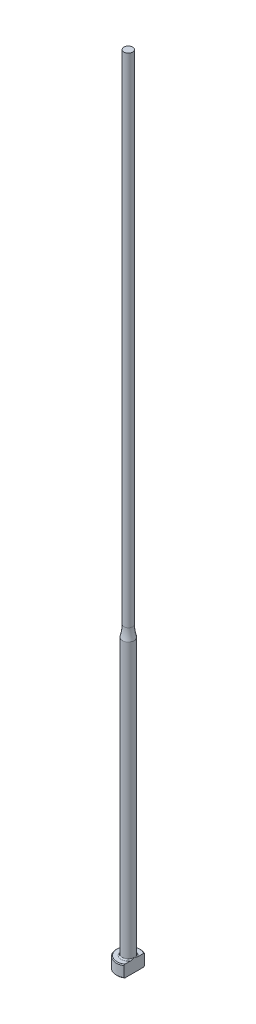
ISO-10303-21;
HEADER;
FILE_DESCRIPTION(('STEP AP214'),'2;1');
FILE_NAME('part.step','',(''),(''),'','','');
FILE_SCHEMA(('AUTOMOTIVE_DESIGN { 1 0 10303 214 1 1 1 1 }'));
ENDSEC;
DATA;
#1=APPLICATION_CONTEXT('core data for automotive mechanical design processes');
#2=APPLICATION_PROTOCOL_DEFINITION('international standard','automotive_design',2000,#1);
#3=PRODUCT_CONTEXT('',#1,'mechanical');
#4=PRODUCT('Part','Part','',(#3));
#5=PRODUCT_RELATED_PRODUCT_CATEGORY('part','',(#4));
#6=PRODUCT_DEFINITION_FORMATION('','',#4);
#7=PRODUCT_DEFINITION_CONTEXT('part definition',#1,'design');
#8=PRODUCT_DEFINITION('design','',#6,#7);
#9=PRODUCT_DEFINITION_SHAPE('','',#8);
#10=(LENGTH_UNIT() NAMED_UNIT(*) SI_UNIT(.MILLI.,.METRE.));
#11=(NAMED_UNIT(*) PLANE_ANGLE_UNIT() SI_UNIT($,.RADIAN.));
#12=(NAMED_UNIT(*) SI_UNIT($,.STERADIAN.) SOLID_ANGLE_UNIT());
#13=UNCERTAINTY_MEASURE_WITH_UNIT(LENGTH_MEASURE(1.E-05),#10,'distance_accuracy_value','');
#14=(GEOMETRIC_REPRESENTATION_CONTEXT(3) GLOBAL_UNCERTAINTY_ASSIGNED_CONTEXT((#13)) GLOBAL_UNIT_ASSIGNED_CONTEXT((#10,
#11,#12)) REPRESENTATION_CONTEXT('',''));
#15=CARTESIAN_POINT('',(0.,0.,0.));
#16=DIRECTION('',(0.,0.,1.));
#17=DIRECTION('',(1.,0.,0.));
#18=AXIS2_PLACEMENT_3D('',#15,#16,#17);
#19=CARTESIAN_POINT('',(-2.99999999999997,3.,0.));
#20=DIRECTION('',(0.,1.,0.));
#21=DIRECTION('',(0.,0.,1.));
#22=AXIS2_PLACEMENT_3D('',#19,#20,#21);
#23=PLANE('',#22);
#24=CARTESIAN_POINT('',(0.,3.,0.));
#25=DIRECTION('',(0.,1.,0.));
#26=DIRECTION('',(0.,0.,1.));
#27=AXIS2_PLACEMENT_3D('',#24,#25,#26);
#28=CIRCLE('',#27,2.79999999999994);
#29=CARTESIAN_POINT('',(1.49999999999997,3.,-2.36431808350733));
#30=VERTEX_POINT('',#29);
#31=CARTESIAN_POINT('',(1.49999999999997,3.,2.36431808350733));
#32=VERTEX_POINT('',#31);
#33=EDGE_CURVE('E187',#30,#32,#28,.T.);
#34=ORIENTED_EDGE('',*,*,#33,.T.);
#35=DIRECTION('',(0.,0.,-1.));
#36=VECTOR('',#35,1.);
#37=CARTESIAN_POINT('',(1.49999999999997,3.,0.));
#38=LINE('',#37,#36);
#39=CARTESIAN_POINT('',(1.49999999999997,3.00000000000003,0.99498743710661));
#40=VERTEX_POINT('',#39);
#41=EDGE_CURVE('E57',#32,#40,#38,.T.);
#42=ORIENTED_EDGE('',*,*,#41,.T.);
#43=CARTESIAN_POINT('',(0.,3.,0.));
#44=DIRECTION('',(0.,1.,0.));
#45=DIRECTION('',(0.,0.,1.));
#46=AXIS2_PLACEMENT_3D('',#43,#44,#45);
#47=CIRCLE('',#46,1.79999999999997);
#48=CARTESIAN_POINT('',(1.49999999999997,3.00000000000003,-0.994987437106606));
#49=VERTEX_POINT('',#48);
#50=EDGE_CURVE('E108',#40,#49,#47,.F.);
#51=ORIENTED_EDGE('',*,*,#50,.T.);
#52=EDGE_CURVE('E137',#49,#30,#38,.T.);
#53=ORIENTED_EDGE('',*,*,#52,.T.);
#54=EDGE_LOOP('',(#34,#42,#51,#53));
#55=FACE_BOUND('',#54,.T.);
#56=ADVANCED_FACE('F32',(#55),#23,.T.);
#57=CARTESIAN_POINT('',(0.,259.958771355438,0.));
#58=DIRECTION('',(0.,1.,0.));
#59=DIRECTION('',(0.,0.,1.));
#60=AXIS2_PLACEMENT_3D('',#57,#58,#59);
#61=CYLINDRICAL_SURFACE('',#60,2.99999999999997);
#62=CARTESIAN_POINT('',(0.,2.79999999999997,0.));
#63=DIRECTION('',(0.,1.,0.));
#64=DIRECTION('',(0.,0.,1.));
#65=AXIS2_PLACEMENT_3D('',#62,#63,#64);
#66=CIRCLE('',#65,2.99999999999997);
#67=CARTESIAN_POINT('',(1.49999999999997,2.79999999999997,2.5980762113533));
#68=VERTEX_POINT('',#67);
#69=CARTESIAN_POINT('',(1.49999999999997,2.79999999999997,-2.5980762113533));
#70=VERTEX_POINT('',#69);
#71=EDGE_CURVE('E105',#68,#70,#66,.F.);
#72=ORIENTED_EDGE('',*,*,#71,.T.);
#73=DIRECTION('',(0.,-1.,0.));
#74=VECTOR('',#73,1.);
#75=CARTESIAN_POINT('',(1.49999999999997,200.,-2.5980762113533));
#76=LINE('',#75,#74);
#77=CARTESIAN_POINT('',(1.49999999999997,0.200000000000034,-2.5980762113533));
#78=VERTEX_POINT('',#77);
#79=EDGE_CURVE('E193',#70,#78,#76,.T.);
#80=ORIENTED_EDGE('',*,*,#79,.T.);
#81=CARTESIAN_POINT('',(0.,0.200000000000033,0.));
#82=DIRECTION('',(0.,-1.,0.));
#83=DIRECTION('',(0.,0.,-1.));
#84=AXIS2_PLACEMENT_3D('',#81,#82,#83);
#85=CIRCLE('',#84,2.99999999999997);
#86=CARTESIAN_POINT('',(1.49999999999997,0.200000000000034,2.5980762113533));
#87=VERTEX_POINT('',#86);
#88=EDGE_CURVE('E100',#78,#87,#85,.F.);
#89=ORIENTED_EDGE('',*,*,#88,.T.);
#90=DIRECTION('',(0.,-1.,0.));
#91=VECTOR('',#90,1.);
#92=CARTESIAN_POINT('',(1.49999999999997,200.,2.5980762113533));
#93=LINE('',#92,#91);
#94=EDGE_CURVE('E93',#68,#87,#93,.T.);
#95=ORIENTED_EDGE('',*,*,#94,.F.);
#96=EDGE_LOOP('',(#72,#80,#89,#95));
#97=FACE_BOUND('',#96,.T.);
#98=ADVANCED_FACE('F158',(#97),#61,.T.);
#99=CARTESIAN_POINT('',(0.,0.,0.));
#100=DIRECTION('',(0.,-1.,0.));
#101=DIRECTION('',(0.,0.,-1.));
#102=AXIS2_PLACEMENT_3D('',#99,#100,#101);
#103=PLANE('',#102);
#104=CARTESIAN_POINT('',(0.,0.,0.));
#105=DIRECTION('',(0.,-1.,0.));
#106=DIRECTION('',(0.,0.,-1.));
#107=AXIS2_PLACEMENT_3D('',#104,#105,#106);
#108=CIRCLE('',#107,2.79999999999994);
#109=CARTESIAN_POINT('',(1.49999999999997,0.,2.36431808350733));
#110=VERTEX_POINT('',#109);
#111=CARTESIAN_POINT('',(1.49999999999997,0.,-2.36431808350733));
#112=VERTEX_POINT('',#111);
#113=EDGE_CURVE('E98',#110,#112,#108,.T.);
#114=ORIENTED_EDGE('',*,*,#113,.T.);
#115=DIRECTION('',(0.,0.,1.));
#116=VECTOR('',#115,1.);
#117=CARTESIAN_POINT('',(1.49999999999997,0.,-2.5980762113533));
#118=LINE('',#117,#116);
#119=EDGE_CURVE('E83',#112,#110,#118,.T.);
#120=ORIENTED_EDGE('',*,*,#119,.T.);
#121=EDGE_LOOP('',(#114,#120));
#122=FACE_BOUND('',#121,.T.);
#123=ADVANCED_FACE('F103',(#122),#103,.T.);
#124=CARTESIAN_POINT('',(0.,3.,0.));
#125=DIRECTION('',(0.,-1.,0.));
#126=DIRECTION('',(0.,0.,-1.));
#127=AXIS2_PLACEMENT_3D('',#124,#125,#126);
#128=CONICAL_SURFACE('',#127,2.79999999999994,0.785398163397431);
#129=ORIENTED_EDGE('',*,*,#71,.F.);
#130=CARTESIAN_POINT('',(1.49999999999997,-0.11174109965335,5.71827621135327));
#131=CARTESIAN_POINT('',(1.49999999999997,0.0136183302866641,5.58866816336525));
#132=CARTESIAN_POINT('',(1.49999999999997,0.138843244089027,5.45892957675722));
#133=CARTESIAN_POINT('',(1.49999999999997,0.388944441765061,5.19911365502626));
#134=CARTESIAN_POINT('',(1.49999999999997,0.513820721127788,5.06903631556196));
#135=CARTESIAN_POINT('',(1.49999999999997,0.763205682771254,4.80840180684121));
#136=CARTESIAN_POINT('',(1.49999999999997,0.887714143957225,4.67784442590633));
#137=CARTESIAN_POINT('',(1.49999999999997,1.13618059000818,4.4162081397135));
#138=CARTESIAN_POINT('',(1.49999999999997,1.26013857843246,4.28512923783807));
#139=CARTESIAN_POINT('',(1.49999999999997,1.50488975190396,4.02490837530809));
#140=CARTESIAN_POINT('',(1.49999999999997,1.62569693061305,3.8957795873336));
#141=CARTESIAN_POINT('',(1.49999999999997,1.86640694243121,3.63668213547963));
#142=CARTESIAN_POINT('',(1.49999999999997,1.98630978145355,3.50671347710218));
#143=CARTESIAN_POINT('',(1.49999999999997,2.2248603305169,3.24567921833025));
#144=CARTESIAN_POINT('',(1.49999999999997,2.3435083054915,3.11461386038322));
#145=CARTESIAN_POINT('',(1.49999999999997,2.5790771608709,2.85094268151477));
#146=CARTESIAN_POINT('',(1.49999999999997,2.69599811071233,2.71833692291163));
#147=CARTESIAN_POINT('',(1.49999999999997,2.88262371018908,2.50255231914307));
#148=CARTESIAN_POINT('',(1.49999999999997,2.95312454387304,2.42006293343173));
#149=CARTESIAN_POINT('',(1.49999999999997,3.09287098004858,2.25401084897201));
#150=CARTESIAN_POINT('',(1.49999999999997,3.16211645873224,2.17044804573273));
#151=CARTESIAN_POINT('',(1.49999999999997,3.29964684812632,2.00105967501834));
#152=CARTESIAN_POINT('',(1.49999999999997,3.36791386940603,1.9152195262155));
#153=CARTESIAN_POINT('',(1.49999999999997,3.50205840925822,1.7417139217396));
#154=CARTESIAN_POINT('',(1.49999999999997,3.56793649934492,1.65404891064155));
#155=CARTESIAN_POINT('',(1.49999999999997,3.69728151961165,1.47490236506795));
#156=CARTESIAN_POINT('',(1.49999999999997,3.76069661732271,1.38338308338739));
#157=CARTESIAN_POINT('',(1.49999999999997,3.88239539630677,1.19675661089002));
#158=CARTESIAN_POINT('',(1.49999999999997,3.94067201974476,1.10164473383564));
#159=CARTESIAN_POINT('',(1.49999999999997,4.048413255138,0.908008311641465));
#160=CARTESIAN_POINT('',(1.49999999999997,4.09797809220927,0.809540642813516));
#161=CARTESIAN_POINT('',(1.49999999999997,4.18432188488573,0.60719295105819));
#162=CARTESIAN_POINT('',(1.49999999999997,4.22114374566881,0.503332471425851));
#163=CARTESIAN_POINT('',(1.49999999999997,4.26099935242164,0.3475775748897));
#164=CARTESIAN_POINT('',(1.49999999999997,4.2715702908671,0.297609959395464));
#165=CARTESIAN_POINT('',(1.49999999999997,4.28794860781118,0.196885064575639));
#166=CARTESIAN_POINT('',(1.49999999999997,4.29375640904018,0.146127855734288));
#167=CARTESIAN_POINT('',(1.49999999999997,4.30019707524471,0.0444388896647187));
#168=CARTESIAN_POINT('',(1.49999999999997,4.30084594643,-0.00649183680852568));
#169=CARTESIAN_POINT('',(1.49999999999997,4.29696416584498,-0.108155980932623));
#170=CARTESIAN_POINT('',(1.49999999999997,4.29243308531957,-0.158889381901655));
#171=CARTESIAN_POINT('',(1.49999999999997,4.27856915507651,-0.259234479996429));
#172=CARTESIAN_POINT('',(1.49999999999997,4.2692782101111,-0.308852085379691));
#173=CARTESIAN_POINT('',(1.49999999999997,4.24647108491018,-0.407110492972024));
#174=CARTESIAN_POINT('',(1.49999999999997,4.23295324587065,-0.45575090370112));
#175=CARTESIAN_POINT('',(1.49999999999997,4.20226175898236,-0.55214996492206));
#176=CARTESIAN_POINT('',(1.49999999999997,4.18506801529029,-0.599902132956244));
#177=CARTESIAN_POINT('',(1.49999999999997,4.14771387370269,-0.694205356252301));
#178=CARTESIAN_POINT('',(1.49999999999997,4.12755408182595,-0.740756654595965));
#179=CARTESIAN_POINT('',(1.49999999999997,4.0632769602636,-0.879166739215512));
#180=CARTESIAN_POINT('',(1.49999999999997,4.01551721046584,-0.969329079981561));
#181=CARTESIAN_POINT('',(1.49999999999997,3.91367909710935,-1.14604316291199));
#182=CARTESIAN_POINT('',(1.49999999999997,3.85959300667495,-1.2325903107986));
#183=CARTESIAN_POINT('',(1.49999999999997,3.74697968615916,-1.40321348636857));
#184=CARTESIAN_POINT('',(1.49999999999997,3.68843573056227,-1.4872783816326));
#185=CARTESIAN_POINT('',(1.49999999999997,3.5684384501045,-1.65322187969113));
#186=CARTESIAN_POINT('',(1.49999999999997,3.50698656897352,-1.73510153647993));
#187=CARTESIAN_POINT('',(1.49999999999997,3.3811567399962,-1.89829823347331));
#188=CARTESIAN_POINT('',(1.49999999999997,3.31675092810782,-1.97959369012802));
#189=CARTESIAN_POINT('',(1.49999999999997,3.18634068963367,-2.14090082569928));
#190=CARTESIAN_POINT('',(1.49999999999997,3.12033609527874,-2.22091236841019));
#191=CARTESIAN_POINT('',(1.49999999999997,2.92086431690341,-2.45906508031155));
#192=CARTESIAN_POINT('',(1.49999999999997,2.78562663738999,-2.61572090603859));
#193=CARTESIAN_POINT('',(1.49999999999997,2.53554498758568,-2.90006295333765));
#194=CARTESIAN_POINT('',(1.49999999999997,2.42114543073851,-3.02814382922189));
#195=CARTESIAN_POINT('',(1.49999999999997,2.1909355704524,-3.28303767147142));
#196=CARTESIAN_POINT('',(1.49999999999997,2.07512522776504,-3.40985060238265));
#197=CARTESIAN_POINT('',(1.49999999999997,1.72597067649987,-3.78913849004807));
#198=CARTESIAN_POINT('',(1.49999999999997,1.49111760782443,-4.04022177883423));
#199=CARTESIAN_POINT('',(1.49999999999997,1.0288247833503,-4.52992803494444));
#200=CARTESIAN_POINT('',(1.49999999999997,0.801477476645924,-4.76863870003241));
#201=CARTESIAN_POINT('',(1.49999999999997,0.459548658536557,-5.12558036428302));
#202=CARTESIAN_POINT('',(1.49999999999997,0.345484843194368,-5.24430773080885));
#203=CARTESIAN_POINT('',(1.49999999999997,0.117071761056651,-5.48148573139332));
#204=CARTESIAN_POINT('',(1.49999999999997,0.00272249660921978,-5.59993636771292));
#205=CARTESIAN_POINT('',(1.49999999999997,-0.11174109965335,-5.71827621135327));
#206=B_SPLINE_CURVE_WITH_KNOTS('',3,(#130,#131,#132,#133,#134,#135,#136,#137,#138,#139,#140,
#141,#142,#143,#144,#145,#146,#147,#148,#149,#150,#151,#152,#153,#154,#155,#156,#157,#158,#159,
#160,#161,#162,#163,#164,#165,#166,#167,#168,#169,#170,#171,#172,#173,#174,#175,#176,#177,#178,
#179,#180,#181,#182,#183,#184,#185,#186,#187,#188,#189,#190,#191,#192,#193,#194,#195,#196,#197,
#198,#199,#200,#201,#202,#203,#204,#205),.UNSPECIFIED.,.F.,.F.,(4,2,2,2,2,2,2,2,2,2,2,2,2,2,2,2,
2,2,2,2,2,2,2,2,2,2,2,2,2,2,2,2,2,2,2,2,2,4),(0.,0.540943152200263,1.08189327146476,
1.62312052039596,2.16434426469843,2.69482920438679,3.22531067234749,3.75567781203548,
4.28602356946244,4.61155053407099,4.9371094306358,5.26610945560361,5.59503024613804,
5.92894782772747,6.26331713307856,6.59354403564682,6.92264800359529,7.07567478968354,
7.2286879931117,7.38122626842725,7.53377717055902,7.6850075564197,7.83629736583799,
7.98843643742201,8.14054446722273,8.44618799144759,8.75220879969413,9.05944044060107,
9.3665211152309,9.6776428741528,9.98879742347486,10.609592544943,11.1247803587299,
11.6399825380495,12.6713544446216,13.6603005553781,14.1542238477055,14.6481430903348),.UNSPECIFIED.);
#207=EDGE_CURVE('E136',#68,#32,#206,.T.);
#208=ORIENTED_EDGE('',*,*,#207,.T.);
#209=ORIENTED_EDGE('',*,*,#33,.F.);
#210=EDGE_CURVE('E128',#30,#70,#206,.T.);
#211=ORIENTED_EDGE('',*,*,#210,.T.);
#212=EDGE_LOOP('',(#129,#208,#209,#211));
#213=FACE_BOUND('',#212,.T.);
#214=ADVANCED_FACE('F144',(#213),#128,.T.);
#215=CARTESIAN_POINT('',(0.,0.200000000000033,0.));
#216=DIRECTION('',(0.,1.,0.));
#217=DIRECTION('',(0.,0.,1.));
#218=AXIS2_PLACEMENT_3D('',#215,#216,#217);
#219=CONICAL_SURFACE('',#218,2.99999999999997,0.785398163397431);
#220=ORIENTED_EDGE('',*,*,#88,.F.);
#221=CARTESIAN_POINT('',(1.49999999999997,3.11174109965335,-5.71827621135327));
#222=CARTESIAN_POINT('',(1.49999999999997,2.98638166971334,-5.58866816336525));
#223=CARTESIAN_POINT('',(1.49999999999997,2.86115675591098,-5.45892957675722));
#224=CARTESIAN_POINT('',(1.49999999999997,2.61105555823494,-5.19911365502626));
#225=CARTESIAN_POINT('',(1.49999999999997,2.48617927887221,-5.06903631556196));
#226=CARTESIAN_POINT('',(1.49999999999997,2.23679431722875,-4.80840180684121));
#227=CARTESIAN_POINT('',(1.49999999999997,2.11228585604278,-4.67784442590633));
#228=CARTESIAN_POINT('',(1.49999999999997,1.86381940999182,-4.4162081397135));
#229=CARTESIAN_POINT('',(1.49999999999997,1.73986142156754,-4.28512923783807));
#230=CARTESIAN_POINT('',(1.49999999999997,1.49511024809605,-4.02490837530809));
#231=CARTESIAN_POINT('',(1.49999999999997,1.37430306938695,-3.8957795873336));
#232=CARTESIAN_POINT('',(1.49999999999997,1.13359305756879,-3.63668213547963));
#233=CARTESIAN_POINT('',(1.49999999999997,1.01369021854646,-3.50671347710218));
#234=CARTESIAN_POINT('',(1.49999999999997,0.775139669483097,-3.24567921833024));
#235=CARTESIAN_POINT('',(1.49999999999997,0.656491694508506,-3.11461386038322));
#236=CARTESIAN_POINT('',(1.49999999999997,0.420922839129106,-2.85094268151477));
#237=CARTESIAN_POINT('',(1.49999999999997,0.304001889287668,-2.71833692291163));
#238=CARTESIAN_POINT('',(1.49999999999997,0.117376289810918,-2.50255231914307));
#239=CARTESIAN_POINT('',(1.49999999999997,0.0468754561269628,-2.42006293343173));
#240=CARTESIAN_POINT('',(1.49999999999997,-0.0928709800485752,-2.254010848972));
#241=CARTESIAN_POINT('',(1.49999999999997,-0.162116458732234,-2.17044804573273));
#242=CARTESIAN_POINT('',(1.49999999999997,-0.299646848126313,-2.00105967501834));
#243=CARTESIAN_POINT('',(1.49999999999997,-0.367913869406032,-1.9152195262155));
#244=CARTESIAN_POINT('',(1.49999999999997,-0.502058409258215,-1.7417139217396));
#245=CARTESIAN_POINT('',(1.49999999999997,-0.567936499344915,-1.65404891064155));
#246=CARTESIAN_POINT('',(1.49999999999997,-0.697281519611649,-1.47490236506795));
#247=CARTESIAN_POINT('',(1.49999999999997,-0.760696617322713,-1.38338308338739));
#248=CARTESIAN_POINT('',(1.49999999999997,-0.882395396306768,-1.19675661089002));
#249=CARTESIAN_POINT('',(1.49999999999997,-0.940672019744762,-1.10164473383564));
#250=CARTESIAN_POINT('',(1.49999999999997,-1.04841325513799,-0.908008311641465));
#251=CARTESIAN_POINT('',(1.49999999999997,-1.09797809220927,-0.809540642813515));
#252=CARTESIAN_POINT('',(1.49999999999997,-1.18432188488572,-0.607192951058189));
#253=CARTESIAN_POINT('',(1.49999999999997,-1.22114374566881,-0.503332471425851));
#254=CARTESIAN_POINT('',(1.49999999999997,-1.26099935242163,-0.3475775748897));
#255=CARTESIAN_POINT('',(1.49999999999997,-1.2715702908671,-0.297609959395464));
#256=CARTESIAN_POINT('',(1.49999999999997,-1.28794860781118,-0.19688506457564));
#257=CARTESIAN_POINT('',(1.49999999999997,-1.29375640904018,-0.146127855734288));
#258=CARTESIAN_POINT('',(1.49999999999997,-1.30019707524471,-0.0444388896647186));
#259=CARTESIAN_POINT('',(1.49999999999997,-1.30084594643,0.00649183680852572));
#260=CARTESIAN_POINT('',(1.49999999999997,-1.29696416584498,0.108155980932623));
#261=CARTESIAN_POINT('',(1.49999999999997,-1.29243308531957,0.158889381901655));
#262=CARTESIAN_POINT('',(1.49999999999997,-1.2785691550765,0.259234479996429));
#263=CARTESIAN_POINT('',(1.49999999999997,-1.2692782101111,0.308852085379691));
#264=CARTESIAN_POINT('',(1.49999999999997,-1.24647108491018,0.407110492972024));
#265=CARTESIAN_POINT('',(1.49999999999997,-1.23295324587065,0.45575090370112));
#266=CARTESIAN_POINT('',(1.49999999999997,-1.20226175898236,0.55214996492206));
#267=CARTESIAN_POINT('',(1.49999999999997,-1.18506801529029,0.599902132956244));
#268=CARTESIAN_POINT('',(1.49999999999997,-1.14771387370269,0.694205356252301));
#269=CARTESIAN_POINT('',(1.49999999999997,-1.12755408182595,0.740756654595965));
#270=CARTESIAN_POINT('',(1.49999999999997,-1.0632769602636,0.879166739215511));
#271=CARTESIAN_POINT('',(1.49999999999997,-1.01551721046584,0.96932907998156));
#272=CARTESIAN_POINT('',(1.49999999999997,-0.913679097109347,1.14604316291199));
#273=CARTESIAN_POINT('',(1.49999999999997,-0.85959300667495,1.2325903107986));
#274=CARTESIAN_POINT('',(1.49999999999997,-0.74697968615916,1.40321348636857));
#275=CARTESIAN_POINT('',(1.49999999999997,-0.688435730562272,1.4872783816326));
#276=CARTESIAN_POINT('',(1.49999999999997,-0.568438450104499,1.65322187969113));
#277=CARTESIAN_POINT('',(1.49999999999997,-0.50698656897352,1.73510153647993));
#278=CARTESIAN_POINT('',(1.49999999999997,-0.381156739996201,1.89829823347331));
#279=CARTESIAN_POINT('',(1.49999999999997,-0.316750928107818,1.97959369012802));
#280=CARTESIAN_POINT('',(1.49999999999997,-0.186340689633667,2.14090082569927));
#281=CARTESIAN_POINT('',(1.49999999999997,-0.120336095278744,2.22091236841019));
#282=CARTESIAN_POINT('',(1.49999999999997,0.0791356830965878,2.45906508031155));
#283=CARTESIAN_POINT('',(1.49999999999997,0.214373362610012,2.61572090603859));
#284=CARTESIAN_POINT('',(1.49999999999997,0.464455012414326,2.90006295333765));
#285=CARTESIAN_POINT('',(1.49999999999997,0.578854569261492,3.02814382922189));
#286=CARTESIAN_POINT('',(1.49999999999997,0.809064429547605,3.28303767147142));
#287=CARTESIAN_POINT('',(1.49999999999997,0.924874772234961,3.40985060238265));
#288=CARTESIAN_POINT('',(1.49999999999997,1.27402932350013,3.78913849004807));
#289=CARTESIAN_POINT('',(1.49999999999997,1.50888239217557,4.04022177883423));
#290=CARTESIAN_POINT('',(1.49999999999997,1.97117521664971,4.52992803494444));
#291=CARTESIAN_POINT('',(1.49999999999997,2.19852252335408,4.76863870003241));
#292=CARTESIAN_POINT('',(1.49999999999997,2.54045134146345,5.12558036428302));
#293=CARTESIAN_POINT('',(1.49999999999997,2.65451515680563,5.24430773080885));
#294=CARTESIAN_POINT('',(1.49999999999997,2.88292823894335,5.48148573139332));
#295=CARTESIAN_POINT('',(1.49999999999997,2.99727750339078,5.59993636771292));
#296=CARTESIAN_POINT('',(1.49999999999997,3.11174109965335,5.71827621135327));
#297=B_SPLINE_CURVE_WITH_KNOTS('',3,(#221,#222,#223,#224,#225,#226,#227,#228,#229,#230,#231,
#232,#233,#234,#235,#236,#237,#238,#239,#240,#241,#242,#243,#244,#245,#246,#247,#248,#249,#250,
#251,#252,#253,#254,#255,#256,#257,#258,#259,#260,#261,#262,#263,#264,#265,#266,#267,#268,#269,
#270,#271,#272,#273,#274,#275,#276,#277,#278,#279,#280,#281,#282,#283,#284,#285,#286,#287,#288,
#289,#290,#291,#292,#293,#294,#295,#296),.UNSPECIFIED.,.F.,.F.,(4,2,2,2,2,2,2,2,2,2,2,2,2,2,2,2,
2,2,2,2,2,2,2,2,2,2,2,2,2,2,2,2,2,2,2,2,2,4),(0.,0.540943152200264,1.08189327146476,
1.62312052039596,2.16434426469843,2.69482920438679,3.22531067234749,3.75567781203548,
4.28602356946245,4.611550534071,4.9371094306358,5.26610945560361,5.59503024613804,
5.92894782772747,6.26331713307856,6.59354403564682,6.92264800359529,7.07567478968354,
7.2286879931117,7.38122626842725,7.53377717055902,7.6850075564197,7.83629736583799,
7.98843643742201,8.14054446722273,8.44618799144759,8.75220879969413,9.05944044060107,
9.3665211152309,9.6776428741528,9.98879742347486,10.609592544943,11.1247803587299,
11.6399825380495,12.6713544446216,13.6603005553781,14.1542238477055,14.6481430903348),.UNSPECIFIED.);
#298=EDGE_CURVE('E86',#78,#112,#297,.T.);
#299=ORIENTED_EDGE('',*,*,#298,.T.);
#300=ORIENTED_EDGE('',*,*,#113,.F.);
#301=EDGE_CURVE('E89',#110,#87,#297,.T.);
#302=ORIENTED_EDGE('',*,*,#301,.T.);
#303=EDGE_LOOP('',(#220,#299,#300,#302));
#304=FACE_BOUND('',#303,.T.);
#305=ADVANCED_FACE('F97',(#304),#219,.T.);
#306=CARTESIAN_POINT('',(0.,3.30000000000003,0.));
#307=DIRECTION('',(0.,1.,0.));
#308=DIRECTION('',(0.,0.,1.));
#309=AXIS2_PLACEMENT_3D('',#306,#307,#308);
#310=TOROIDAL_SURFACE('',#309,1.79999999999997,0.3);
#311=CARTESIAN_POINT('',(1.49999999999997,3.30000000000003,0.));
#312=CARTESIAN_POINT('',(1.49999999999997,3.300000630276,3.41555678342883E-12));
#313=CARTESIAN_POINT('',(1.49999999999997,3.30000126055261,-1.15373640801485E-07));
#314=CARTESIAN_POINT('',(1.49999999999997,3.3000024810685,-4.90631575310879E-07));
#315=CARTESIAN_POINT('',(1.49999999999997,3.30000307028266,-7.53296670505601E-07));
#316=CARTESIAN_POINT('',(1.49999999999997,3.30000424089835,-1.38757096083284E-06));
#317=CARTESIAN_POINT('',(1.49999999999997,3.300004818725,-1.76563001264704E-06));
#318=CARTESIAN_POINT('',(1.49999999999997,3.30000591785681,-2.58768006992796E-06));
#319=CARTESIAN_POINT('',(1.49999999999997,3.30000643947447,-3.03127014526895E-06));
#320=CARTESIAN_POINT('',(1.49999999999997,3.30000815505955,-4.60021967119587E-06));
#321=CARTESIAN_POINT('',(1.49999999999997,3.30000927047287,-5.8124152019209E-06));
#322=CARTESIAN_POINT('',(1.49999999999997,3.30001128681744,-8.33989413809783E-06));
#323=CARTESIAN_POINT('',(1.49999999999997,3.30001219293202,-9.65128157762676E-06));
#324=CARTESIAN_POINT('',(1.49999999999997,3.30001551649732,-1.46782505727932E-05));
#325=CARTESIAN_POINT('',(1.49999999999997,3.30001775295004,-1.8517976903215E-05));
#326=CARTESIAN_POINT('',(1.49999999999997,3.30002148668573,-2.61616194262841E-05));
#327=CARTESIAN_POINT('',(1.49999999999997,3.30002302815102,-2.99447742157E-05));
#328=CARTESIAN_POINT('',(1.49999999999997,3.30002943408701,-4.58003743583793E-05));
#329=CARTESIAN_POINT('',(1.49999999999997,3.3000341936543,-5.79079078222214E-05));
#330=CARTESIAN_POINT('',(1.49999999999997,3.30004197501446,-8.07263755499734E-05));
#331=CARTESIAN_POINT('',(1.49999999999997,3.30004514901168,-9.13834709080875E-05));
#332=CARTESIAN_POINT('',(1.49999999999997,3.30006989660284,-0.000167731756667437));
#333=CARTESIAN_POINT('',(1.49999999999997,3.30010092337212,-0.000229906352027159));
#334=CARTESIAN_POINT('',(1.49999999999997,3.30021632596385,-0.000470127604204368));
#335=CARTESIAN_POINT('',(1.49999999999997,3.30029368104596,-0.000650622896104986));
#336=CARTESIAN_POINT('',(1.49999999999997,3.30059619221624,-0.00134589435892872));
#337=CARTESIAN_POINT('',(1.49999999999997,3.30082870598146,-0.00185814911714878));
#338=CARTESIAN_POINT('',(1.49999999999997,3.30176696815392,-0.00393547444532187));
#339=CARTESIAN_POINT('',(1.49999999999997,3.30246445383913,-0.00550332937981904));
#340=CARTESIAN_POINT('',(1.49999999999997,3.31426785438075,-0.0320229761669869));
#341=CARTESIAN_POINT('',(1.49999999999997,3.32544800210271,-0.0569503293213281));
#342=CARTESIAN_POINT('',(1.49999999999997,3.34725700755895,-0.105984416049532));
#343=CARTESIAN_POINT('',(1.49999999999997,3.35789134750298,-0.130088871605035));
#344=CARTESIAN_POINT('',(1.49999999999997,3.38015321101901,-0.181096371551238));
#345=CARTESIAN_POINT('',(1.49999999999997,3.39175804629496,-0.208009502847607));
#346=CARTESIAN_POINT('',(1.49999999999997,3.41469034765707,-0.262264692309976));
#347=CARTESIAN_POINT('',(1.49999999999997,3.42601398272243,-0.289608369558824));
#348=CARTESIAN_POINT('',(1.49999999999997,3.45363212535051,-0.35820378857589));
#349=CARTESIAN_POINT('',(1.49999999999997,3.46959026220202,-0.39959288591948));
#350=CARTESIAN_POINT('',(1.49999999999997,3.49940505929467,-0.482097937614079));
#351=CARTESIAN_POINT('',(1.49999999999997,3.51330033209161,-0.523199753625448));
#352=CARTESIAN_POINT('',(1.49999999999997,3.53552507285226,-0.595497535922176));
#353=CARTESIAN_POINT('',(1.49999999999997,3.54436834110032,-0.626532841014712));
#354=CARTESIAN_POINT('',(1.49999999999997,3.56052427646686,-0.6891760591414));
#355=CARTESIAN_POINT('',(1.49999999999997,3.5678279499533,-0.720786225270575));
#356=CARTESIAN_POINT('',(1.49999999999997,3.5875075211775,-0.819524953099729));
#357=CARTESIAN_POINT('',(1.49999999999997,3.59661044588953,-0.88742909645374));
#358=CARTESIAN_POINT('',(1.49999999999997,3.60059842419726,-0.991180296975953));
#359=CARTESIAN_POINT('',(1.49999999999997,3.60019840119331,-1.02684364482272));
#360=CARTESIAN_POINT('',(1.49999999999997,3.59497085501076,-1.097505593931));
#361=CARTESIAN_POINT('',(1.49999999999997,3.59019295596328,-1.13250716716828));
#362=CARTESIAN_POINT('',(1.49999999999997,3.57687734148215,-1.19353096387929));
#363=CARTESIAN_POINT('',(1.49999999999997,3.56943875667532,-1.21978854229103));
#364=CARTESIAN_POINT('',(1.49999999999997,3.55063748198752,-1.27094658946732));
#365=CARTESIAN_POINT('',(1.49999999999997,3.53927342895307,-1.29584658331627));
#366=CARTESIAN_POINT('',(1.49999999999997,3.51660016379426,-1.33501873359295));
#367=CARTESIAN_POINT('',(1.49999999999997,3.50657738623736,-1.35003296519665));
#368=CARTESIAN_POINT('',(1.49999999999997,3.48437469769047,-1.37837252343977));
#369=CARTESIAN_POINT('',(1.49999999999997,3.47219867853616,-1.39170082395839));
#370=CARTESIAN_POINT('',(1.49999999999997,3.44835614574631,-1.41349417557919));
#371=CARTESIAN_POINT('',(1.49999999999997,3.43709185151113,-1.42239673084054));
#372=CARTESIAN_POINT('',(1.49999999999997,3.41325256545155,-1.43825467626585));
#373=CARTESIAN_POINT('',(1.49999999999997,3.40067804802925,-1.44521076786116));
#374=CARTESIAN_POINT('',(1.49999999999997,3.37433767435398,-1.45677158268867));
#375=CARTESIAN_POINT('',(1.49999999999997,3.36056203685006,-1.46135438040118));
#376=CARTESIAN_POINT('',(1.49999999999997,3.33237324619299,-1.46767730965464));
#377=CARTESIAN_POINT('',(1.49999999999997,3.31796076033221,-1.46942034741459));
#378=CARTESIAN_POINT('',(1.49999999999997,3.29122479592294,-1.4698720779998));
#379=CARTESIAN_POINT('',(1.49999999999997,3.27890664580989,-1.468990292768));
#380=CARTESIAN_POINT('',(1.49999999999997,3.25461019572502,-1.4651157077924));
#381=CARTESIAN_POINT('',(1.49999999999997,3.2426318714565,-1.46212305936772));
#382=CARTESIAN_POINT('',(1.49999999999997,3.21959683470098,-1.4543117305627));
#383=CARTESIAN_POINT('',(1.49999999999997,3.20852542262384,-1.44953579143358));
#384=CARTESIAN_POINT('',(1.49999999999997,3.18721125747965,-1.43840957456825));
#385=CARTESIAN_POINT('',(1.49999999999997,3.1769687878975,-1.43205876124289));
#386=CARTESIAN_POINT('',(1.49999999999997,3.15325976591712,-1.41506353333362));
#387=CARTESIAN_POINT('',(1.49999999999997,3.14027750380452,-1.40374235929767));
#388=CARTESIAN_POINT('',(1.49999999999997,3.11630720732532,-1.37914825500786));
#389=CARTESIAN_POINT('',(1.49999999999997,3.10532420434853,-1.36587054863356));
#390=CARTESIAN_POINT('',(1.49999999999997,3.08100891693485,-1.33197272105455));
#391=CARTESIAN_POINT('',(1.49999999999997,3.06867625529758,-1.31063843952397));
#392=CARTESIAN_POINT('',(1.49999999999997,3.04751867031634,-1.26637455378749));
#393=CARTESIAN_POINT('',(1.49999999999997,3.03869240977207,-1.24344556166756));
#394=CARTESIAN_POINT('',(1.49999999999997,3.01978360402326,-1.18316534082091));
#395=CARTESIAN_POINT('',(1.49999999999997,3.01191472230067,-1.14512623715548));
#396=CARTESIAN_POINT('',(1.49999999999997,3.00188285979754,-1.06789971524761));
#397=CARTESIAN_POINT('',(1.49999999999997,2.99979735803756,-1.02870374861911));
#398=CARTESIAN_POINT('',(1.49999999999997,3.00021727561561,-0.953160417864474));
#399=CARTESIAN_POINT('',(1.49999999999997,3.00240673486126,-0.916808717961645));
#400=CARTESIAN_POINT('',(1.49999999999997,3.0099643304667,-0.844432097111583));
#401=CARTESIAN_POINT('',(1.49999999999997,3.01533462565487,-0.808407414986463));
#402=CARTESIAN_POINT('',(1.49999999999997,3.02828086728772,-0.738670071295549));
#403=CARTESIAN_POINT('',(1.49999999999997,3.03573028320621,-0.704933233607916));
#404=CARTESIAN_POINT('',(1.49999999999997,3.05243174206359,-0.638128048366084));
#405=CARTESIAN_POINT('',(1.49999999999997,3.06167285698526,-0.605056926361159));
#406=CARTESIAN_POINT('',(1.49999999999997,3.08440652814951,-0.53019513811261));
#407=CARTESIAN_POINT('',(1.49999999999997,3.09836576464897,-0.488547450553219));
#408=CARTESIAN_POINT('',(1.49999999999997,3.1283820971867,-0.404954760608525));
#409=CARTESIAN_POINT('',(1.49999999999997,3.14447968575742,-0.363024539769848));
#410=CARTESIAN_POINT('',(1.49999999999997,3.17238454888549,-0.293508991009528));
#411=CARTESIAN_POINT('',(1.49999999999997,3.18384249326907,-0.265781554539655));
#412=CARTESIAN_POINT('',(1.49999999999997,3.20705854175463,-0.210769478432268));
#413=CARTESIAN_POINT('',(1.49999999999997,3.21881265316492,-0.183483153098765));
#414=CARTESIAN_POINT('',(1.49999999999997,3.24136702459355,-0.131772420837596));
#415=CARTESIAN_POINT('',(1.49999999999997,3.25214361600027,-0.107337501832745));
#416=CARTESIAN_POINT('',(1.49999999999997,3.27424746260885,-0.0576321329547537));
#417=CARTESIAN_POINT('',(1.49999999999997,3.28558038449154,-0.0323640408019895));
#418=CARTESIAN_POINT('',(1.49999999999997,3.29753556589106,-0.00550327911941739));
#419=CARTESIAN_POINT('',(1.49999999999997,3.29823307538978,-0.00393537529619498));
#420=CARTESIAN_POINT('',(1.49999999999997,3.29917134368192,-0.00185803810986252));
#421=CARTESIAN_POINT('',(1.49999999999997,3.29940384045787,-0.00134582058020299));
#422=CARTESIAN_POINT('',(1.49999999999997,3.29970633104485,-0.000650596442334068));
#423=CARTESIAN_POINT('',(1.49999999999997,3.29978368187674,-0.000470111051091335));
#424=CARTESIAN_POINT('',(1.49999999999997,3.29989907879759,-0.000229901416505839));
#425=CARTESIAN_POINT('',(1.49999999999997,3.29993010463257,-0.000167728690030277));
#426=CARTESIAN_POINT('',(1.49999999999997,3.29995485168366,-9.13825689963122E-05));
#427=CARTESIAN_POINT('',(1.49999999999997,3.29995802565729,-8.07256241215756E-05));
#428=CARTESIAN_POINT('',(1.49999999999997,3.29996580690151,-5.79074820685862E-05));
#429=CARTESIAN_POINT('',(1.49999999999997,3.29997056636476,-4.5800119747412E-05));
#430=CARTESIAN_POINT('',(1.49999999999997,3.29997697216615,-2.99447119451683E-05));
#431=CARTESIAN_POINT('',(1.49999999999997,3.2999785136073,-2.61615817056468E-05));
#432=CARTESIAN_POINT('',(1.49999999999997,3.2999822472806,-1.85179845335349E-05));
#433=CARTESIAN_POINT('',(1.49999999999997,3.29998448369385,-1.46782782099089E-05));
#434=CARTESIAN_POINT('',(1.49999999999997,3.2999878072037,-9.65132752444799E-06));
#435=CARTESIAN_POINT('',(1.49999999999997,3.299988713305,-8.33994202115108E-06));
#436=CARTESIAN_POINT('',(1.49999999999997,3.29999072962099,-5.81246426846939E-06));
#437=CARTESIAN_POINT('',(1.49999999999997,3.29999184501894,-4.600267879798E-06));
#438=CARTESIAN_POINT('',(1.49999999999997,3.29999356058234,-3.03131394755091E-06));
#439=CARTESIAN_POINT('',(1.49999999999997,3.29999408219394,-2.58772196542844E-06));
#440=CARTESIAN_POINT('',(1.49999999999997,3.2999951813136,-1.76566701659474E-06));
#441=CARTESIAN_POINT('',(1.49999999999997,3.29999575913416,-1.38760497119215E-06));
#442=CARTESIAN_POINT('',(1.49999999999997,3.29999692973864,-7.53323425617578E-07));
#443=CARTESIAN_POINT('',(1.49999999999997,3.29999751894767,-4.90654189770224E-07));
#444=CARTESIAN_POINT('',(1.49999999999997,3.29999873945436,-1.15386267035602E-07));
#445=CARTESIAN_POINT('',(1.49999999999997,3.29999936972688,-3.41554144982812E-12));
#446=CARTESIAN_POINT('',(1.49999999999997,3.30000000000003,0.));
#447=B_SPLINE_CURVE_WITH_KNOTS('',3,(#311,#312,#313,#314,#315,#316,#317,#318,#319,#320,#321,
#322,#323,#324,#325,#326,#327,#328,#329,#330,#331,#332,#333,#334,#335,#336,#337,#338,#339,#340,
#341,#342,#343,#344,#345,#346,#347,#348,#349,#350,#351,#352,#353,#354,#355,#356,#357,#358,#359,
#360,#361,#362,#363,#364,#365,#366,#367,#368,#369,#370,#371,#372,#373,#374,#375,#376,#377,#378,
#379,#380,#381,#382,#383,#384,#385,#386,#387,#388,#389,#390,#391,#392,#393,#394,#395,#396,#397,
#398,#399,#400,#401,#402,#403,#404,#405,#406,#407,#408,#409,#410,#411,#412,#413,#414,#415,#416,
#417,#418,#419,#420,#421,#422,#423,#424,#425,#426,#427,#428,#429,#430,#431,#432,#433,#434,#435,
#436,#437,#438,#439,#440,#441,#442,#443,#444,#445,#446),.UNSPECIFIED.,.T.,.F.,(4,2,2,2,2,2,2,2,
2,2,2,2,2,2,2,2,2,2,2,2,2,2,2,2,2,2,2,2,2,2,2,2,2,2,2,2,2,2,2,2,2,2,2,2,2,2,2,2,2,2,2,2,2,2,2,2,
2,2,2,2,2,2,2,2,2,2,2,4),(0.,1.88906036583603E-06,3.8150959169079E-06,5.87892837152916E-06,
7.93062024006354E-06,1.28480890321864E-05,1.76261717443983E-05,3.0909918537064E-05,
4.31529750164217E-05,8.21699329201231E-05,0.000115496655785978,0.000323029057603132,
0.000912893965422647,0.00259963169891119,0.00774858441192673,0.0896975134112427,
0.168737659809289,0.256660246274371,0.345444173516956,0.478492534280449,0.608603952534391,
0.705372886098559,0.802692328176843,1.00719557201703,1.11399616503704,1.21960092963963,
1.30124317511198,1.38291380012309,1.43690814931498,1.49080588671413,1.53371524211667,
1.57660911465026,1.61989249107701,1.66313154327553,1.69999492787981,1.73685567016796,
1.77288440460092,1.80892540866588,1.86031324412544,1.91182866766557,1.98534297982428,
2.05882922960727,2.1747172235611,2.29215041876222,2.40123170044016,2.51038710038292,
2.613972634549,2.71694519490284,2.84866234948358,2.98337525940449,3.07337666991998,
3.16250453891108,3.24262397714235,3.32569301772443,3.3308421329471,3.33252874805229,
3.33311858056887,3.33332610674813,3.33335943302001,3.33339844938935,3.3334106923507,
3.33342397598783,3.33342875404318,3.33343367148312,3.33343572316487,3.33343778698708,
3.33343971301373,3.33344160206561),.UNSPECIFIED.);
#448=CARTESIAN_POINT('',(1.49999999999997,3.30000000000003,0.));
#449=VERTEX_POINT('',#448);
#450=EDGE_CURVE('E11',#49,#449,#447,.T.);
#451=ORIENTED_EDGE('',*,*,#450,.F.);
#452=ORIENTED_EDGE('',*,*,#50,.F.);
#453=CARTESIAN_POINT('',(1.49999999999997,3.30000000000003,0.));
#454=CARTESIAN_POINT('',(1.49999999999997,3.29999936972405,-3.41547770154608E-12));
#455=CARTESIAN_POINT('',(1.49999999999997,3.29999873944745,1.15373640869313E-07));
#456=CARTESIAN_POINT('',(1.49999999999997,3.29999751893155,4.90631575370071E-07));
#457=CARTESIAN_POINT('',(1.49999999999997,3.29999692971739,7.53296670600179E-07));
#458=CARTESIAN_POINT('',(1.49999999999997,3.2999957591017,1.38757096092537E-06));
#459=CARTESIAN_POINT('',(1.49999999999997,3.29999518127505,1.76563001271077E-06));
#460=CARTESIAN_POINT('',(1.49999999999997,3.29999408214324,2.58768007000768E-06));
#461=CARTESIAN_POINT('',(1.49999999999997,3.29999356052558,3.03127014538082E-06));
#462=CARTESIAN_POINT('',(1.49999999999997,3.2999918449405,4.60021967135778E-06));
#463=CARTESIAN_POINT('',(1.49999999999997,3.29999072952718,5.81241520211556E-06));
#464=CARTESIAN_POINT('',(1.49999999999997,3.29998871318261,8.33989413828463E-06));
#465=CARTESIAN_POINT('',(1.49999999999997,3.29998780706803,9.65128157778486E-06));
#466=CARTESIAN_POINT('',(1.49999999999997,3.29998448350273,1.46782505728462E-05));
#467=CARTESIAN_POINT('',(1.49999999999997,3.29998224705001,1.85179769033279E-05));
#468=CARTESIAN_POINT('',(1.49999999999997,3.29997851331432,2.61616194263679E-05));
#469=CARTESIAN_POINT('',(1.49999999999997,3.29997697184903,2.99447742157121E-05));
#470=CARTESIAN_POINT('',(1.49999999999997,3.29997056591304,4.58003743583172E-05));
#471=CARTESIAN_POINT('',(1.49999999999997,3.29996580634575,5.79079078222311E-05));
#472=CARTESIAN_POINT('',(1.49999999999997,3.29995802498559,8.07263755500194E-05));
#473=CARTESIAN_POINT('',(1.49999999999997,3.29995485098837,9.1383470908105E-05));
#474=CARTESIAN_POINT('',(1.49999999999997,3.29993010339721,0.000167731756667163));
#475=CARTESIAN_POINT('',(1.49999999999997,3.29989907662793,0.000229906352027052));
#476=CARTESIAN_POINT('',(1.49999999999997,3.2997836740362,0.000470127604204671));
#477=CARTESIAN_POINT('',(1.49999999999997,3.2997063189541,0.000650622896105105));
#478=CARTESIAN_POINT('',(1.49999999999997,3.29940380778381,0.00134589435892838));
#479=CARTESIAN_POINT('',(1.49999999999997,3.29917129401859,0.00185814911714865));
#480=CARTESIAN_POINT('',(1.49999999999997,3.29823303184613,0.00393547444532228));
#481=CARTESIAN_POINT('',(1.49999999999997,3.29753554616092,0.00550332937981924));
#482=CARTESIAN_POINT('',(1.49999999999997,3.2857321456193,0.0320229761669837));
#483=CARTESIAN_POINT('',(1.49999999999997,3.27455199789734,0.0569503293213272));
#484=CARTESIAN_POINT('',(1.49999999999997,3.2527429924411,0.105984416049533));
#485=CARTESIAN_POINT('',(1.49999999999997,3.24210865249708,0.130088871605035));
#486=CARTESIAN_POINT('',(1.49999999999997,3.21984678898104,0.181096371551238));
#487=CARTESIAN_POINT('',(1.49999999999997,3.20824195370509,0.208009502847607));
#488=CARTESIAN_POINT('',(1.49999999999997,3.18530965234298,0.262264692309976));
#489=CARTESIAN_POINT('',(1.49999999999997,3.17398601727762,0.289608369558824));
#490=CARTESIAN_POINT('',(1.49999999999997,3.14636787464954,0.35820378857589));
#491=CARTESIAN_POINT('',(1.49999999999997,3.13040973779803,0.39959288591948));
#492=CARTESIAN_POINT('',(1.49999999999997,3.10059494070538,0.482097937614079));
#493=CARTESIAN_POINT('',(1.49999999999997,3.08669966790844,0.523199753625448));
#494=CARTESIAN_POINT('',(1.49999999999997,3.06447492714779,0.595497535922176));
#495=CARTESIAN_POINT('',(1.49999999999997,3.05563165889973,0.626532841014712));
#496=CARTESIAN_POINT('',(1.49999999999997,3.03947572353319,0.6891760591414));
#497=CARTESIAN_POINT('',(1.49999999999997,3.03217205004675,0.720786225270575));
#498=CARTESIAN_POINT('',(1.49999999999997,3.01249247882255,0.819524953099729));
#499=CARTESIAN_POINT('',(1.49999999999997,3.00338955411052,0.88742909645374));
#500=CARTESIAN_POINT('',(1.49999999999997,2.99940157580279,0.991180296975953));
#501=CARTESIAN_POINT('',(1.49999999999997,2.99980159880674,1.02684364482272));
#502=CARTESIAN_POINT('',(1.49999999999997,3.00502914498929,1.097505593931));
#503=CARTESIAN_POINT('',(1.49999999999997,3.00980704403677,1.13250716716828));
#504=CARTESIAN_POINT('',(1.49999999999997,3.0231226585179,1.19353096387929));
#505=CARTESIAN_POINT('',(1.49999999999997,3.03056124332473,1.21978854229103));
#506=CARTESIAN_POINT('',(1.49999999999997,3.04936251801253,1.27094658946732));
#507=CARTESIAN_POINT('',(1.49999999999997,3.06072657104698,1.29584658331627));
#508=CARTESIAN_POINT('',(1.49999999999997,3.08339983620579,1.33501873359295));
#509=CARTESIAN_POINT('',(1.49999999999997,3.09342261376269,1.35003296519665));
#510=CARTESIAN_POINT('',(1.49999999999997,3.11562530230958,1.37837252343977));
#511=CARTESIAN_POINT('',(1.49999999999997,3.12780132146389,1.39170082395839));
#512=CARTESIAN_POINT('',(1.49999999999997,3.15164385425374,1.41349417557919));
#513=CARTESIAN_POINT('',(1.49999999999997,3.16290814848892,1.42239673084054));
#514=CARTESIAN_POINT('',(1.49999999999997,3.1867474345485,1.43825467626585));
#515=CARTESIAN_POINT('',(1.49999999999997,3.1993219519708,1.44521076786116));
#516=CARTESIAN_POINT('',(1.49999999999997,3.22566232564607,1.45677158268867));
#517=CARTESIAN_POINT('',(1.49999999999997,3.23943796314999,1.46135438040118));
#518=CARTESIAN_POINT('',(1.49999999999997,3.26762675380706,1.46767730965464));
#519=CARTESIAN_POINT('',(1.49999999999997,3.28203923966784,1.46942034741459));
#520=CARTESIAN_POINT('',(1.49999999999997,3.30877520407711,1.4698720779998));
#521=CARTESIAN_POINT('',(1.49999999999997,3.32109335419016,1.468990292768));
#522=CARTESIAN_POINT('',(1.49999999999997,3.34538980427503,1.4651157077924));
#523=CARTESIAN_POINT('',(1.49999999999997,3.35736812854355,1.46212305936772));
#524=CARTESIAN_POINT('',(1.49999999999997,3.38040316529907,1.4543117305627));
#525=CARTESIAN_POINT('',(1.49999999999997,3.39147457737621,1.44953579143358));
#526=CARTESIAN_POINT('',(1.49999999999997,3.4127887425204,1.43840957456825));
#527=CARTESIAN_POINT('',(1.49999999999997,3.42303121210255,1.43205876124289));
#528=CARTESIAN_POINT('',(1.49999999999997,3.44674023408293,1.41506353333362));
#529=CARTESIAN_POINT('',(1.49999999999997,3.45972249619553,1.40374235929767));
#530=CARTESIAN_POINT('',(1.49999999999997,3.48369279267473,1.37914825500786));
#531=CARTESIAN_POINT('',(1.49999999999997,3.49467579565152,1.36587054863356));
#532=CARTESIAN_POINT('',(1.49999999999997,3.5189910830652,1.33197272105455));
#533=CARTESIAN_POINT('',(1.49999999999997,3.53132374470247,1.31063843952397));
#534=CARTESIAN_POINT('',(1.49999999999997,3.55248132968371,1.26637455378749));
#535=CARTESIAN_POINT('',(1.49999999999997,3.56130759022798,1.24344556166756));
#536=CARTESIAN_POINT('',(1.49999999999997,3.58021639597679,1.18316534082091));
#537=CARTESIAN_POINT('',(1.49999999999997,3.58808527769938,1.14512623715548));
#538=CARTESIAN_POINT('',(1.49999999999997,3.59811714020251,1.06789971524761));
#539=CARTESIAN_POINT('',(1.49999999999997,3.60020264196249,1.02870374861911));
#540=CARTESIAN_POINT('',(1.49999999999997,3.59978272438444,0.953160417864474));
#541=CARTESIAN_POINT('',(1.49999999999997,3.59759326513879,0.916808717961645));
#542=CARTESIAN_POINT('',(1.49999999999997,3.59003566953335,0.844432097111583));
#543=CARTESIAN_POINT('',(1.49999999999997,3.58466537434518,0.808407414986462));
#544=CARTESIAN_POINT('',(1.49999999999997,3.57171913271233,0.738670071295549));
#545=CARTESIAN_POINT('',(1.49999999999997,3.56426971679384,0.704933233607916));
#546=CARTESIAN_POINT('',(1.49999999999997,3.54756825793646,0.638128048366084));
#547=CARTESIAN_POINT('',(1.49999999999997,3.53832714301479,0.605056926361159));
#548=CARTESIAN_POINT('',(1.49999999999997,3.51559347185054,0.53019513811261));
#549=CARTESIAN_POINT('',(1.49999999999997,3.50163423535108,0.488547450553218));
#550=CARTESIAN_POINT('',(1.49999999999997,3.47161790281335,0.404954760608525));
#551=CARTESIAN_POINT('',(1.49999999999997,3.45552031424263,0.363024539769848));
#552=CARTESIAN_POINT('',(1.49999999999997,3.42761545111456,0.293508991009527));
#553=CARTESIAN_POINT('',(1.49999999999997,3.41615750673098,0.265781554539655));
#554=CARTESIAN_POINT('',(1.49999999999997,3.39294145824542,0.210769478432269));
#555=CARTESIAN_POINT('',(1.49999999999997,3.38118734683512,0.183483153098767));
#556=CARTESIAN_POINT('',(1.49999999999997,3.3586329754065,0.131772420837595));
#557=CARTESIAN_POINT('',(1.49999999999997,3.3478563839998,0.10733750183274));
#558=CARTESIAN_POINT('',(1.49999999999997,3.32575253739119,0.0576321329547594));
#559=CARTESIAN_POINT('',(1.49999999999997,3.31441961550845,0.0323640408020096));
#560=CARTESIAN_POINT('',(1.49999999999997,3.30246443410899,0.00550327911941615));
#561=CARTESIAN_POINT('',(1.49999999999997,3.30176692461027,0.00393537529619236));
#562=CARTESIAN_POINT('',(1.49999999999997,3.30082865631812,0.00185803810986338));
#563=CARTESIAN_POINT('',(1.49999999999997,3.30059615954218,0.00134582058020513));
#564=CARTESIAN_POINT('',(1.49999999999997,3.3002936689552,0.000650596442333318));
#565=CARTESIAN_POINT('',(1.49999999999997,3.30021631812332,0.000470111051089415));
#566=CARTESIAN_POINT('',(1.49999999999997,3.30010092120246,0.000229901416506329));
#567=CARTESIAN_POINT('',(1.49999999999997,3.30006989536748,0.000167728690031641));
#568=CARTESIAN_POINT('',(1.49999999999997,3.30004514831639,9.13825689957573E-05));
#569=CARTESIAN_POINT('',(1.49999999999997,3.30004197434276,8.07256241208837E-05));
#570=CARTESIAN_POINT('',(1.49999999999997,3.30003419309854,5.79074820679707E-05));
#571=CARTESIAN_POINT('',(1.49999999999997,3.30002943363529,4.58001197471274E-05));
#572=CARTESIAN_POINT('',(1.49999999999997,3.3000230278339,2.99447119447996E-05));
#573=CARTESIAN_POINT('',(1.49999999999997,3.30002148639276,2.61615817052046E-05));
#574=CARTESIAN_POINT('',(1.49999999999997,3.30001775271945,1.85179845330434E-05));
#575=CARTESIAN_POINT('',(1.49999999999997,3.3000155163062,1.46782782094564E-05));
#576=CARTESIAN_POINT('',(1.49999999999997,3.30001219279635,9.65132752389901E-06));
#577=CARTESIAN_POINT('',(1.49999999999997,3.30001128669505,8.33994202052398E-06));
#578=CARTESIAN_POINT('',(1.49999999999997,3.30000927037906,5.8124642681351E-06));
#579=CARTESIAN_POINT('',(1.49999999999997,3.30000815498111,4.60026787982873E-06));
#580=CARTESIAN_POINT('',(1.49999999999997,3.30000643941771,3.03131394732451E-06));
#581=CARTESIAN_POINT('',(1.49999999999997,3.30000591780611,2.58772196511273E-06));
#582=CARTESIAN_POINT('',(1.49999999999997,3.30000481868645,1.76566701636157E-06));
#583=CARTESIAN_POINT('',(1.49999999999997,3.30000424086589,1.38760497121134E-06));
#584=CARTESIAN_POINT('',(1.49999999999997,3.3000030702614,7.53323425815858E-07));
#585=CARTESIAN_POINT('',(1.49999999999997,3.30000248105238,4.90654189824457E-07));
#586=CARTESIAN_POINT('',(1.49999999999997,3.30000126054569,1.15386266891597E-07));
#587=CARTESIAN_POINT('',(1.49999999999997,3.30000063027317,3.41546236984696E-12));
#588=CARTESIAN_POINT('',(1.49999999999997,3.30000000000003,0.));
#589=B_SPLINE_CURVE_WITH_KNOTS('',3,(#453,#454,#455,#456,#457,#458,#459,#460,#461,#462,#463,
#464,#465,#466,#467,#468,#469,#470,#471,#472,#473,#474,#475,#476,#477,#478,#479,#480,#481,#482,
#483,#484,#485,#486,#487,#488,#489,#490,#491,#492,#493,#494,#495,#496,#497,#498,#499,#500,#501,
#502,#503,#504,#505,#506,#507,#508,#509,#510,#511,#512,#513,#514,#515,#516,#517,#518,#519,#520,
#521,#522,#523,#524,#525,#526,#527,#528,#529,#530,#531,#532,#533,#534,#535,#536,#537,#538,#539,
#540,#541,#542,#543,#544,#545,#546,#547,#548,#549,#550,#551,#552,#553,#554,#555,#556,#557,#558,
#559,#560,#561,#562,#563,#564,#565,#566,#567,#568,#569,#570,#571,#572,#573,#574,#575,#576,#577,
#578,#579,#580,#581,#582,#583,#584,#585,#586,#587,#588),.UNSPECIFIED.,.T.,.F.,(4,2,2,2,2,2,2,2,
2,2,2,2,2,2,2,2,2,2,2,2,2,2,2,2,2,2,2,2,2,2,2,2,2,2,2,2,2,2,2,2,2,2,2,2,2,2,2,2,2,2,2,2,2,2,2,2,
2,2,2,2,2,2,2,2,2,2,2,4),(0.,1.88906036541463E-06,3.81509591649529E-06,5.87892837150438E-06,
7.93062024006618E-06,1.28480890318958E-05,1.76261717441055E-05,3.09099185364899E-05,
4.3152975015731E-05,8.21699329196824E-05,0.000115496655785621,0.000323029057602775,
0.000912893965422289,0.00259963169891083,0.00774858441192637,0.0896975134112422,
0.168737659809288,0.256660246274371,0.345444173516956,0.478492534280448,0.60860395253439,
0.705372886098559,0.802692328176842,1.00719557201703,1.11399616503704,1.21960092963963,
1.30124317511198,1.38291380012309,1.43690814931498,1.49080588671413,1.53371524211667,
1.57660911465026,1.61989249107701,1.66313154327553,1.69999492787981,1.73685567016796,
1.77288440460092,1.80892540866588,1.86031324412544,1.91182866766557,1.98534297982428,
2.05882922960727,2.1747172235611,2.29215041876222,2.40123170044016,2.51038710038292,
2.613972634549,2.71694519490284,2.84866234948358,2.98337525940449,3.07337666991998,
3.16250453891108,3.24262397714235,3.32569301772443,3.3308421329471,3.33252874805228,
3.33311858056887,3.33332610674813,3.33335943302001,3.33339844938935,3.3334106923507,
3.33342397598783,3.33342875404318,3.33343367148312,3.33343572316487,3.33343778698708,
3.33343971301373,3.33344160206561),.UNSPECIFIED.);
#590=EDGE_CURVE('E46',#449,#40,#589,.T.);
#591=ORIENTED_EDGE('',*,*,#590,.F.);
#592=CARTESIAN_POINT('',(0.,3.30000000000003,0.));
#593=DIRECTION('',(0.,1.,0.));
#594=DIRECTION('',(0.,0.,1.));
#595=AXIS2_PLACEMENT_3D('',#592,#593,#594);
#596=CIRCLE('',#595,1.49999999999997);
#597=EDGE_CURVE('E104',#449,#449,#596,.T.);
#598=ORIENTED_EDGE('',*,*,#597,.F.);
#599=EDGE_LOOP('',(#451,#452,#591,#598));
#600=FACE_BOUND('',#599,.T.);
#601=ADVANCED_FACE('F34',(#600),#310,.F.);
#602=CARTESIAN_POINT('',(-1.09999999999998,200.,0.));
#603=DIRECTION('',(0.,1.,0.));
#604=DIRECTION('',(0.,0.,1.));
#605=AXIS2_PLACEMENT_3D('',#602,#603,#604);
#606=PLANE('',#605);
#607=CARTESIAN_POINT('',(0.,200.,0.));
#608=DIRECTION('',(0.,1.,0.));
#609=DIRECTION('',(0.,0.,1.));
#610=AXIS2_PLACEMENT_3D('',#607,#608,#609);
#611=CIRCLE('',#610,1.09999999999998);
#612=CARTESIAN_POINT('',(0.,200.,1.09999999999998));
#613=VERTEX_POINT('',#612);
#614=EDGE_CURVE('E186',#613,#613,#611,.T.);
#615=ORIENTED_EDGE('',*,*,#614,.T.);
#616=EDGE_LOOP('',(#615));
#617=FACE_BOUND('',#616,.T.);
#618=ADVANCED_FACE('F149',(#617),#606,.T.);
#619=CARTESIAN_POINT('',(0.,259.958771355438,0.));
#620=DIRECTION('',(0.,1.,0.));
#621=DIRECTION('',(0.,0.,1.));
#622=AXIS2_PLACEMENT_3D('',#619,#620,#621);
#623=CYLINDRICAL_SURFACE('',#622,1.09999999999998);
#624=CARTESIAN_POINT('',(0.,75.,0.));
#625=DIRECTION('',(0.,1.,0.));
#626=DIRECTION('',(0.,0.,1.));
#627=AXIS2_PLACEMENT_3D('',#624,#625,#626);
#628=CIRCLE('',#627,1.09999999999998);
#629=CARTESIAN_POINT('',(0.,75.,1.09999999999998));
#630=VERTEX_POINT('',#629);
#631=EDGE_CURVE('E183',#630,#630,#628,.T.);
#632=ORIENTED_EDGE('',*,*,#631,.T.);
#633=EDGE_LOOP('',(#632));
#634=FACE_BOUND('',#633,.T.);
#635=ORIENTED_EDGE('',*,*,#614,.F.);
#636=EDGE_LOOP('',(#635));
#637=FACE_BOUND('',#636,.T.);
#638=ADVANCED_FACE('F172',(#634,#637),#623,.T.);
#639=CARTESIAN_POINT('',(0.,75.,0.));
#640=DIRECTION('',(0.,1.,0.));
#641=DIRECTION('',(0.,0.,1.));
#642=AXIS2_PLACEMENT_3D('',#639,#640,#641);
#643=TOROIDAL_SURFACE('',#642,11.1,10.);
#644=CARTESIAN_POINT('',(0.,72.2,0.));
#645=DIRECTION('',(0.,1.,0.));
#646=DIRECTION('',(0.,0.,1.));
#647=AXIS2_PLACEMENT_3D('',#644,#645,#646);
#648=CIRCLE('',#647,1.49999999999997);
#649=CARTESIAN_POINT('',(0.,72.2,1.49999999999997));
#650=VERTEX_POINT('',#649);
#651=EDGE_CURVE('E101',#650,#650,#648,.T.);
#652=ORIENTED_EDGE('',*,*,#651,.T.);
#653=EDGE_LOOP('',(#652));
#654=FACE_BOUND('',#653,.T.);
#655=ORIENTED_EDGE('',*,*,#631,.F.);
#656=EDGE_LOOP('',(#655));
#657=FACE_BOUND('',#656,.T.);
#658=ADVANCED_FACE('F169',(#654,#657),#643,.F.);
#659=CARTESIAN_POINT('',(0.,259.958771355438,0.));
#660=DIRECTION('',(0.,1.,0.));
#661=DIRECTION('',(0.,0.,1.));
#662=AXIS2_PLACEMENT_3D('',#659,#660,#661);
#663=CYLINDRICAL_SURFACE('',#662,1.49999999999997);
#664=ORIENTED_EDGE('',*,*,#597,.T.);
#665=EDGE_LOOP('',(#664));
#666=FACE_BOUND('',#665,.T.);
#667=ORIENTED_EDGE('',*,*,#651,.F.);
#668=EDGE_LOOP('',(#667));
#669=FACE_BOUND('',#668,.T.);
#670=ADVANCED_FACE('F122',(#666,#669),#663,.T.);
#671=CARTESIAN_POINT('',(1.49999999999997,200.,-2.5980762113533));
#672=DIRECTION('',(1.,0.,0.));
#673=DIRECTION('',(0.,0.,-1.));
#674=AXIS2_PLACEMENT_3D('',#671,#672,#673);
#675=PLANE('',#674);
#676=ORIENTED_EDGE('',*,*,#79,.F.);
#677=ORIENTED_EDGE('',*,*,#210,.F.);
#678=ORIENTED_EDGE('',*,*,#52,.F.);
#679=ORIENTED_EDGE('',*,*,#450,.T.);
#680=ORIENTED_EDGE('',*,*,#590,.T.);
#681=ORIENTED_EDGE('',*,*,#41,.F.);
#682=ORIENTED_EDGE('',*,*,#207,.F.);
#683=ORIENTED_EDGE('',*,*,#94,.T.);
#684=ORIENTED_EDGE('',*,*,#301,.F.);
#685=ORIENTED_EDGE('',*,*,#119,.F.);
#686=ORIENTED_EDGE('',*,*,#298,.F.);
#687=EDGE_LOOP('',(#676,#677,#678,#679,#680,#681,#682,#683,#684,#685,#686));
#688=FACE_BOUND('',#687,.T.);
#689=ADVANCED_FACE('F85',(#688),#675,.T.);
#690=CLOSED_SHELL('',(#56,#98,#123,#214,#305,#601,#618,#638,#658,#670,#689));
#691=MANIFOLD_SOLID_BREP('B2',#690);
#692=ADVANCED_BREP_SHAPE_REPRESENTATION('',(#18,#691),#14);
#693=SHAPE_DEFINITION_REPRESENTATION(#9,#692);
ENDSEC;
END-ISO-10303-21;
